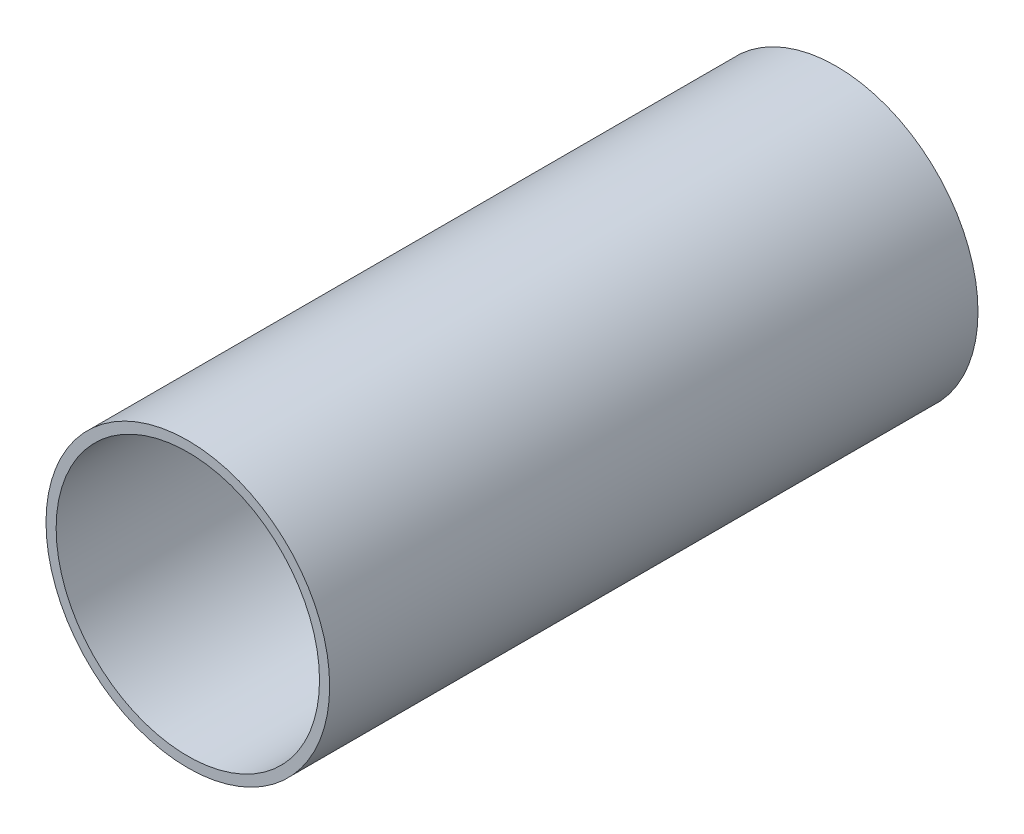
ISO-10303-21;
HEADER;
FILE_DESCRIPTION(('STEP AP214'),'2;1');
FILE_NAME('part.step','',(''),(''),'','','');
FILE_SCHEMA(('AUTOMOTIVE_DESIGN { 1 0 10303 214 1 1 1 1 }'));
ENDSEC;
DATA;
#1=APPLICATION_CONTEXT('core data for automotive mechanical design processes');
#2=APPLICATION_PROTOCOL_DEFINITION('international standard','automotive_design',2000,#1);
#3=PRODUCT_CONTEXT('',#1,'mechanical');
#4=PRODUCT('Part','Part','',(#3));
#5=PRODUCT_RELATED_PRODUCT_CATEGORY('part','',(#4));
#6=PRODUCT_DEFINITION_FORMATION('','',#4);
#7=PRODUCT_DEFINITION_CONTEXT('part definition',#1,'design');
#8=PRODUCT_DEFINITION('design','',#6,#7);
#9=PRODUCT_DEFINITION_SHAPE('','',#8);
#10=(LENGTH_UNIT() NAMED_UNIT(*) SI_UNIT(.MILLI.,.METRE.));
#11=(NAMED_UNIT(*) PLANE_ANGLE_UNIT() SI_UNIT($,.RADIAN.));
#12=(NAMED_UNIT(*) SI_UNIT($,.STERADIAN.) SOLID_ANGLE_UNIT());
#13=UNCERTAINTY_MEASURE_WITH_UNIT(LENGTH_MEASURE(1.E-05),#10,'distance_accuracy_value','');
#14=(GEOMETRIC_REPRESENTATION_CONTEXT(3) GLOBAL_UNCERTAINTY_ASSIGNED_CONTEXT((#13)) GLOBAL_UNIT_ASSIGNED_CONTEXT((#10,
#11,#12)) REPRESENTATION_CONTEXT('',''));
#15=CARTESIAN_POINT('',(0.,0.,0.));
#16=DIRECTION('',(0.,0.,1.));
#17=DIRECTION('',(1.,0.,0.));
#18=AXIS2_PLACEMENT_3D('',#15,#16,#17);
#19=CARTESIAN_POINT('',(0.,0.,101.6));
#20=DIRECTION('',(0.,0.,1.));
#21=DIRECTION('',(1.,0.,0.));
#22=AXIS2_PLACEMENT_3D('',#19,#20,#21);
#23=PLANE('',#22);
#24=CARTESIAN_POINT('',(0.,0.,101.6));
#25=DIRECTION('',(0.,0.,1.));
#26=DIRECTION('',(1.,0.,0.));
#27=AXIS2_PLACEMENT_3D('',#24,#25,#26);
#28=CIRCLE('',#27,22.225);
#29=CARTESIAN_POINT('',(22.225,0.,101.6));
#30=VERTEX_POINT('',#29);
#31=EDGE_CURVE('E10',#30,#30,#28,.T.);
#32=ORIENTED_EDGE('',*,*,#31,.T.);
#33=EDGE_LOOP('',(#32));
#34=FACE_BOUND('',#33,.T.);
#35=CARTESIAN_POINT('',(0.,0.,101.6));
#36=DIRECTION('',(0.,0.,1.));
#37=DIRECTION('',(1.,0.,0.));
#38=AXIS2_PLACEMENT_3D('',#35,#36,#37);
#39=CIRCLE('',#38,20.6375);
#40=CARTESIAN_POINT('',(20.6375,0.,101.6));
#41=VERTEX_POINT('',#40);
#42=EDGE_CURVE('E40',#41,#41,#39,.T.);
#43=ORIENTED_EDGE('',*,*,#42,.F.);
#44=EDGE_LOOP('',(#43));
#45=FACE_BOUND('',#44,.T.);
#46=ADVANCED_FACE('F29',(#34,#45),#23,.T.);
#47=CARTESIAN_POINT('',(0.,0.,0.));
#48=DIRECTION('',(0.,0.,1.));
#49=DIRECTION('',(1.,0.,0.));
#50=AXIS2_PLACEMENT_3D('',#47,#48,#49);
#51=PLANE('',#50);
#52=CARTESIAN_POINT('',(0.,0.,0.));
#53=DIRECTION('',(0.,0.,1.));
#54=DIRECTION('',(1.,0.,0.));
#55=AXIS2_PLACEMENT_3D('',#52,#53,#54);
#56=CIRCLE('',#55,22.225);
#57=CARTESIAN_POINT('',(22.225,0.,0.));
#58=VERTEX_POINT('',#57);
#59=EDGE_CURVE('E36',#58,#58,#56,.T.);
#60=ORIENTED_EDGE('',*,*,#59,.F.);
#61=EDGE_LOOP('',(#60));
#62=FACE_BOUND('',#61,.T.);
#63=CARTESIAN_POINT('',(0.,0.,0.));
#64=DIRECTION('',(0.,0.,1.));
#65=DIRECTION('',(1.,0.,0.));
#66=AXIS2_PLACEMENT_3D('',#63,#64,#65);
#67=CIRCLE('',#66,20.6375);
#68=CARTESIAN_POINT('',(20.6375,0.,0.));
#69=VERTEX_POINT('',#68);
#70=EDGE_CURVE('E44',#69,#69,#67,.T.);
#71=ORIENTED_EDGE('',*,*,#70,.T.);
#72=EDGE_LOOP('',(#71));
#73=FACE_BOUND('',#72,.T.);
#74=ADVANCED_FACE('F50',(#62,#73),#51,.F.);
#75=CARTESIAN_POINT('',(0.,0.,101.6));
#76=DIRECTION('',(0.,0.,-1.));
#77=DIRECTION('',(-1.,0.,0.));
#78=AXIS2_PLACEMENT_3D('',#75,#76,#77);
#79=CYLINDRICAL_SURFACE('',#78,22.225);
#80=ORIENTED_EDGE('',*,*,#31,.F.);
#81=EDGE_LOOP('',(#80));
#82=FACE_BOUND('',#81,.T.);
#83=ORIENTED_EDGE('',*,*,#59,.T.);
#84=EDGE_LOOP('',(#83));
#85=FACE_BOUND('',#84,.T.);
#86=ADVANCED_FACE('F31',(#82,#85),#79,.T.);
#87=CARTESIAN_POINT('',(0.,0.,101.6));
#88=DIRECTION('',(0.,0.,-1.));
#89=DIRECTION('',(-1.,0.,0.));
#90=AXIS2_PLACEMENT_3D('',#87,#88,#89);
#91=CYLINDRICAL_SURFACE('',#90,20.6375);
#92=ORIENTED_EDGE('',*,*,#42,.T.);
#93=EDGE_LOOP('',(#92));
#94=FACE_BOUND('',#93,.T.);
#95=ORIENTED_EDGE('',*,*,#70,.F.);
#96=EDGE_LOOP('',(#95));
#97=FACE_BOUND('',#96,.T.);
#98=ADVANCED_FACE('F52',(#94,#97),#91,.F.);
#99=CLOSED_SHELL('',(#46,#74,#86,#98));
#100=MANIFOLD_SOLID_BREP('B2',#99);
#101=ADVANCED_BREP_SHAPE_REPRESENTATION('',(#18,#100),#14);
#102=SHAPE_DEFINITION_REPRESENTATION(#9,#101);
ENDSEC;
END-ISO-10303-21;
